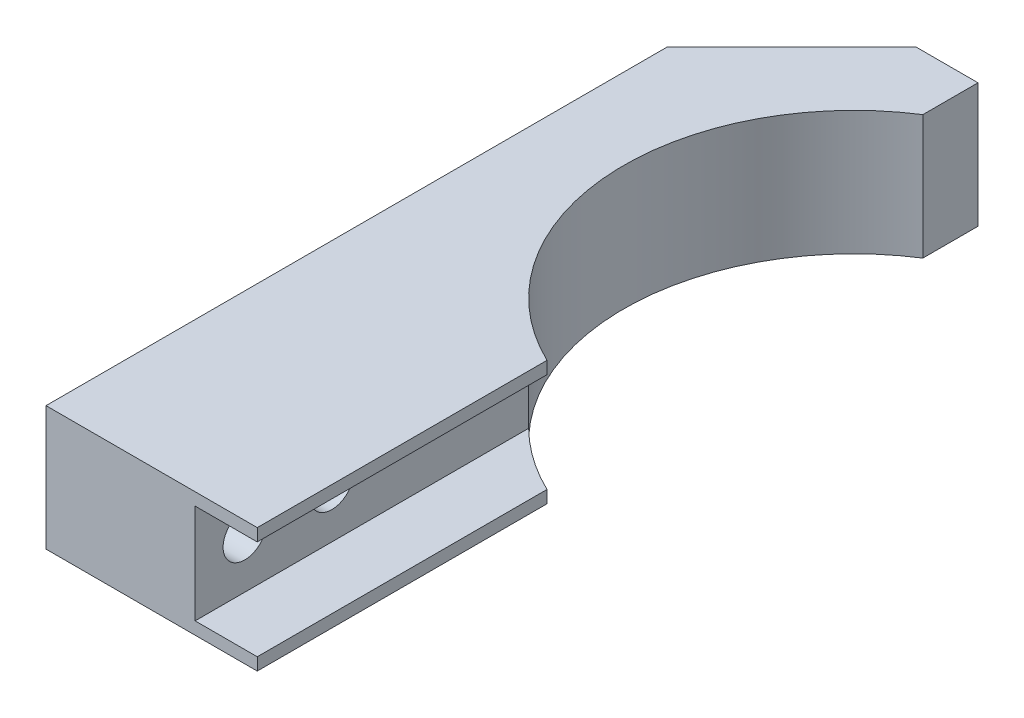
ISO-10303-21;
HEADER;
FILE_DESCRIPTION(('STEP AP214'),'2;1');
FILE_NAME('part.step','',(''),(''),'','','');
FILE_SCHEMA(('AUTOMOTIVE_DESIGN { 1 0 10303 214 1 1 1 1 }'));
ENDSEC;
DATA;
#1=APPLICATION_CONTEXT('core data for automotive mechanical design processes');
#2=APPLICATION_PROTOCOL_DEFINITION('international standard','automotive_design',2000,#1);
#3=PRODUCT_CONTEXT('',#1,'mechanical');
#4=PRODUCT('Part','Part','',(#3));
#5=PRODUCT_RELATED_PRODUCT_CATEGORY('part','',(#4));
#6=PRODUCT_DEFINITION_FORMATION('','',#4);
#7=PRODUCT_DEFINITION_CONTEXT('part definition',#1,'design');
#8=PRODUCT_DEFINITION('design','',#6,#7);
#9=PRODUCT_DEFINITION_SHAPE('','',#8);
#10=(LENGTH_UNIT() NAMED_UNIT(*) SI_UNIT(.MILLI.,.METRE.));
#11=(NAMED_UNIT(*) PLANE_ANGLE_UNIT() SI_UNIT($,.RADIAN.));
#12=(NAMED_UNIT(*) SI_UNIT($,.STERADIAN.) SOLID_ANGLE_UNIT());
#13=UNCERTAINTY_MEASURE_WITH_UNIT(LENGTH_MEASURE(1.E-05),#10,'distance_accuracy_value','');
#14=(GEOMETRIC_REPRESENTATION_CONTEXT(3) GLOBAL_UNCERTAINTY_ASSIGNED_CONTEXT((#13)) GLOBAL_UNIT_ASSIGNED_CONTEXT((#10,
#11,#12)) REPRESENTATION_CONTEXT('',''));
#15=CARTESIAN_POINT('',(0.,0.,0.));
#16=DIRECTION('',(0.,0.,1.));
#17=DIRECTION('',(1.,0.,0.));
#18=AXIS2_PLACEMENT_3D('',#15,#16,#17);
#19=CARTESIAN_POINT('',(-20.,5.,26.));
#20=DIRECTION('',(-1.,0.,0.));
#21=DIRECTION('',(0.,0.,1.));
#22=AXIS2_PLACEMENT_3D('',#19,#20,#21);
#23=PLANE('',#22);
#24=CARTESIAN_POINT('',(-20.,5.,26.));
#25=DIRECTION('',(1.,0.,0.));
#26=DIRECTION('',(0.,0.,-1.));
#27=AXIS2_PLACEMENT_3D('',#24,#25,#26);
#28=CIRCLE('',#27,1.75);
#29=CARTESIAN_POINT('',(-20.,5.,24.25));
#30=VERTEX_POINT('',#29);
#31=EDGE_CURVE('E149',#30,#30,#28,.T.);
#32=ORIENTED_EDGE('',*,*,#31,.T.);
#33=EDGE_LOOP('',(#32));
#34=FACE_BOUND('',#33,.T.);
#35=CARTESIAN_POINT('',(-20.,5.,26.));
#36=DIRECTION('',(-1.,0.,0.));
#37=DIRECTION('',(0.,0.,1.));
#38=AXIS2_PLACEMENT_3D('',#35,#36,#37);
#39=CIRCLE('',#38,3.);
#40=CARTESIAN_POINT('',(-20.,5.,29.));
#41=VERTEX_POINT('',#40);
#42=EDGE_CURVE('E146',#41,#41,#39,.T.);
#43=ORIENTED_EDGE('',*,*,#42,.T.);
#44=EDGE_LOOP('',(#43));
#45=FACE_BOUND('',#44,.T.);
#46=ADVANCED_FACE('F17',(#34,#45),#23,.T.);
#47=CARTESIAN_POINT('',(-20.,5.,19.));
#48=DIRECTION('',(-1.,0.,0.));
#49=DIRECTION('',(0.,0.,1.));
#50=AXIS2_PLACEMENT_3D('',#47,#48,#49);
#51=PLANE('',#50);
#52=CARTESIAN_POINT('',(-20.,5.,19.));
#53=DIRECTION('',(1.,0.,0.));
#54=DIRECTION('',(0.,0.,-1.));
#55=AXIS2_PLACEMENT_3D('',#52,#53,#54);
#56=CIRCLE('',#55,1.75);
#57=CARTESIAN_POINT('',(-20.,5.,17.25));
#58=VERTEX_POINT('',#57);
#59=EDGE_CURVE('E20',#58,#58,#56,.T.);
#60=ORIENTED_EDGE('',*,*,#59,.T.);
#61=EDGE_LOOP('',(#60));
#62=FACE_BOUND('',#61,.T.);
#63=CARTESIAN_POINT('',(-20.,5.,19.));
#64=DIRECTION('',(-1.,0.,0.));
#65=DIRECTION('',(0.,0.,1.));
#66=AXIS2_PLACEMENT_3D('',#63,#64,#65);
#67=CIRCLE('',#66,3.);
#68=CARTESIAN_POINT('',(-20.,5.,22.));
#69=VERTEX_POINT('',#68);
#70=EDGE_CURVE('E143',#69,#69,#67,.T.);
#71=ORIENTED_EDGE('',*,*,#70,.T.);
#72=EDGE_LOOP('',(#71));
#73=FACE_BOUND('',#72,.T.);
#74=ADVANCED_FACE('F158',(#62,#73),#51,.T.);
#75=CARTESIAN_POINT('',(-25.,5.,19.));
#76=DIRECTION('',(1.,0.,0.));
#77=DIRECTION('',(0.,0.,-1.));
#78=AXIS2_PLACEMENT_3D('',#75,#76,#77);
#79=CYLINDRICAL_SURFACE('',#78,1.75);
#80=ORIENTED_EDGE('',*,*,#59,.F.);
#81=EDGE_LOOP('',(#80));
#82=FACE_BOUND('',#81,.T.);
#83=CARTESIAN_POINT('',(-13.,5.,19.));
#84=DIRECTION('',(1.,0.,0.));
#85=DIRECTION('',(0.,0.,-1.));
#86=AXIS2_PLACEMENT_3D('',#83,#84,#85);
#87=CIRCLE('',#86,1.75);
#88=CARTESIAN_POINT('',(-13.,5.,17.25));
#89=VERTEX_POINT('',#88);
#90=EDGE_CURVE('E140',#89,#89,#87,.T.);
#91=ORIENTED_EDGE('',*,*,#90,.T.);
#92=EDGE_LOOP('',(#91));
#93=FACE_BOUND('',#92,.T.);
#94=ADVANCED_FACE('F161',(#82,#93),#79,.F.);
#95=CARTESIAN_POINT('',(-25.,5.,26.));
#96=DIRECTION('',(1.,0.,0.));
#97=DIRECTION('',(0.,0.,-1.));
#98=AXIS2_PLACEMENT_3D('',#95,#96,#97);
#99=CYLINDRICAL_SURFACE('',#98,1.75);
#100=ORIENTED_EDGE('',*,*,#31,.F.);
#101=EDGE_LOOP('',(#100));
#102=FACE_BOUND('',#101,.T.);
#103=CARTESIAN_POINT('',(-13.,5.,26.));
#104=DIRECTION('',(1.,0.,0.));
#105=DIRECTION('',(0.,0.,-1.));
#106=AXIS2_PLACEMENT_3D('',#103,#104,#105);
#107=CIRCLE('',#106,1.75);
#108=CARTESIAN_POINT('',(-13.,5.,24.25));
#109=VERTEX_POINT('',#108);
#110=EDGE_CURVE('E112',#109,#109,#107,.T.);
#111=ORIENTED_EDGE('',*,*,#110,.T.);
#112=EDGE_LOOP('',(#111));
#113=FACE_BOUND('',#112,.T.);
#114=ADVANCED_FACE('F164',(#102,#113),#99,.F.);
#115=CARTESIAN_POINT('',(-8.,0.,1.33753255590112));
#116=DIRECTION('',(-1.,0.,0.));
#117=DIRECTION('',(0.,0.,1.));
#118=AXIS2_PLACEMENT_3D('',#115,#116,#117);
#119=PLANE('',#118);
#120=DIRECTION('',(0.,0.,1.));
#121=VECTOR('',#120,1.);
#122=CARTESIAN_POINT('',(-7.99999999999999,9.,-0.772126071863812));
#123=LINE('',#122,#121);
#124=CARTESIAN_POINT('',(-7.99999999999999,9.,30.));
#125=VERTEX_POINT('',#124);
#126=CARTESIAN_POINT('',(-8.,9.,6.68082731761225));
#127=VERTEX_POINT('',#126);
#128=EDGE_CURVE('E111',#125,#127,#123,.F.);
#129=ORIENTED_EDGE('',*,*,#128,.T.);
#130=DIRECTION('',(0.,1.,0.));
#131=VECTOR('',#130,1.);
#132=CARTESIAN_POINT('',(-8.,0.,6.68082731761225));
#133=LINE('',#132,#131);
#134=CARTESIAN_POINT('',(-8.,10.,6.68082731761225));
#135=VERTEX_POINT('',#134);
#136=EDGE_CURVE('E151',#135,#127,#133,.F.);
#137=ORIENTED_EDGE('',*,*,#136,.F.);
#138=DIRECTION('',(0.,0.,1.));
#139=VECTOR('',#138,1.);
#140=CARTESIAN_POINT('',(-7.99999999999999,10.,0.));
#141=LINE('',#140,#139);
#142=CARTESIAN_POINT('',(-7.99999999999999,10.,30.));
#143=VERTEX_POINT('',#142);
#144=EDGE_CURVE('E221',#143,#135,#141,.F.);
#145=ORIENTED_EDGE('',*,*,#144,.F.);
#146=DIRECTION('',(0.,1.,0.));
#147=VECTOR('',#146,1.);
#148=CARTESIAN_POINT('',(-7.99999999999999,0.,30.));
#149=LINE('',#148,#147);
#150=EDGE_CURVE('E148',#125,#143,#149,.T.);
#151=ORIENTED_EDGE('',*,*,#150,.F.);
#152=EDGE_LOOP('',(#129,#137,#145,#151));
#153=FACE_BOUND('',#152,.T.);
#154=ADVANCED_FACE('F345',(#153),#119,.F.);
#155=CARTESIAN_POINT('',(-20.,5.,26.));
#156=DIRECTION('',(-1.,0.,0.));
#157=DIRECTION('',(0.,0.,1.));
#158=AXIS2_PLACEMENT_3D('',#155,#156,#157);
#159=CYLINDRICAL_SURFACE('',#158,3.);
#160=ORIENTED_EDGE('',*,*,#42,.F.);
#161=EDGE_LOOP('',(#160));
#162=FACE_BOUND('',#161,.T.);
#163=CARTESIAN_POINT('',(-25.,5.,26.));
#164=DIRECTION('',(-1.,0.,0.));
#165=DIRECTION('',(0.,0.,1.));
#166=AXIS2_PLACEMENT_3D('',#163,#164,#165);
#167=CIRCLE('',#166,3.);
#168=CARTESIAN_POINT('',(-25.,5.,29.));
#169=VERTEX_POINT('',#168);
#170=EDGE_CURVE('E134',#169,#169,#167,.T.);
#171=ORIENTED_EDGE('',*,*,#170,.T.);
#172=EDGE_LOOP('',(#171));
#173=FACE_BOUND('',#172,.T.);
#174=ADVANCED_FACE('F343',(#162,#173),#159,.F.);
#175=CARTESIAN_POINT('',(-20.,5.,19.));
#176=DIRECTION('',(-1.,0.,0.));
#177=DIRECTION('',(0.,0.,1.));
#178=AXIS2_PLACEMENT_3D('',#175,#176,#177);
#179=CYLINDRICAL_SURFACE('',#178,3.);
#180=ORIENTED_EDGE('',*,*,#70,.F.);
#181=EDGE_LOOP('',(#180));
#182=FACE_BOUND('',#181,.T.);
#183=CARTESIAN_POINT('',(-25.,5.,19.));
#184=DIRECTION('',(-1.,0.,0.));
#185=DIRECTION('',(0.,0.,1.));
#186=AXIS2_PLACEMENT_3D('',#183,#184,#185);
#187=CIRCLE('',#186,3.);
#188=CARTESIAN_POINT('',(-25.,5.,22.));
#189=VERTEX_POINT('',#188);
#190=EDGE_CURVE('E130',#189,#189,#187,.T.);
#191=ORIENTED_EDGE('',*,*,#190,.T.);
#192=EDGE_LOOP('',(#191));
#193=FACE_BOUND('',#192,.T.);
#194=ADVANCED_FACE('F179',(#182,#193),#179,.F.);
#195=CARTESIAN_POINT('',(-13.,1.,-0.772126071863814));
#196=DIRECTION('',(0.,-1.,0.));
#197=DIRECTION('',(0.,0.,-1.));
#198=AXIS2_PLACEMENT_3D('',#195,#196,#197);
#199=PLANE('',#198);
#200=CARTESIAN_POINT('',(0.,1.,-10.));
#201=DIRECTION('',(0.,1.,0.));
#202=DIRECTION('',(0.,0.,1.));
#203=AXIS2_PLACEMENT_3D('',#200,#201,#202);
#204=CIRCLE('',#203,18.5);
#205=CARTESIAN_POINT('',(-8.,1.,6.68082731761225));
#206=VERTEX_POINT('',#205);
#207=CARTESIAN_POINT('',(-13.,1.,3.16244658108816));
#208=VERTEX_POINT('',#207);
#209=EDGE_CURVE('E118',#206,#208,#204,.F.);
#210=ORIENTED_EDGE('',*,*,#209,.T.);
#211=DIRECTION('',(0.,0.,1.));
#212=VECTOR('',#211,1.);
#213=CARTESIAN_POINT('',(-13.,1.,0.));
#214=LINE('',#213,#212);
#215=CARTESIAN_POINT('',(-13.,1.,30.));
#216=VERTEX_POINT('',#215);
#217=EDGE_CURVE('E104',#208,#216,#214,.T.);
#218=ORIENTED_EDGE('',*,*,#217,.T.);
#219=DIRECTION('',(-1.,0.,0.));
#220=VECTOR('',#219,1.);
#221=CARTESIAN_POINT('',(-25.,0.999999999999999,30.));
#222=LINE('',#221,#220);
#223=CARTESIAN_POINT('',(-7.99999999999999,0.999999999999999,30.));
#224=VERTEX_POINT('',#223);
#225=EDGE_CURVE('E259',#216,#224,#222,.F.);
#226=ORIENTED_EDGE('',*,*,#225,.T.);
#227=DIRECTION('',(0.,0.,1.));
#228=VECTOR('',#227,1.);
#229=CARTESIAN_POINT('',(-8.,0.999999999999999,1.33753255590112));
#230=LINE('',#229,#228);
#231=EDGE_CURVE('E97',#224,#206,#230,.F.);
#232=ORIENTED_EDGE('',*,*,#231,.T.);
#233=EDGE_LOOP('',(#210,#218,#226,#232));
#234=FACE_BOUND('',#233,.T.);
#235=ADVANCED_FACE('F123',(#234),#199,.F.);
#236=CARTESIAN_POINT('',(-13.,0.,0.));
#237=DIRECTION('',(-1.,0.,0.));
#238=DIRECTION('',(0.,0.,1.));
#239=AXIS2_PLACEMENT_3D('',#236,#237,#238);
#240=PLANE('',#239);
#241=DIRECTION('',(0.,1.,0.));
#242=VECTOR('',#241,1.);
#243=CARTESIAN_POINT('',(-13.,0.,3.16244658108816));
#244=LINE('',#243,#242);
#245=CARTESIAN_POINT('',(-13.,9.,3.16244658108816));
#246=VERTEX_POINT('',#245);
#247=EDGE_CURVE('E108',#208,#246,#244,.T.);
#248=ORIENTED_EDGE('',*,*,#247,.T.);
#249=DIRECTION('',(0.,0.,1.));
#250=VECTOR('',#249,1.);
#251=CARTESIAN_POINT('',(-13.,9.,-0.772126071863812));
#252=LINE('',#251,#250);
#253=CARTESIAN_POINT('',(-13.,9.,30.));
#254=VERTEX_POINT('',#253);
#255=EDGE_CURVE('E228',#246,#254,#252,.T.);
#256=ORIENTED_EDGE('',*,*,#255,.T.);
#257=DIRECTION('',(0.,1.,0.));
#258=VECTOR('',#257,1.);
#259=CARTESIAN_POINT('',(-13.,10.,30.));
#260=LINE('',#259,#258);
#261=EDGE_CURVE('E110',#254,#216,#260,.F.);
#262=ORIENTED_EDGE('',*,*,#261,.T.);
#263=ORIENTED_EDGE('',*,*,#217,.F.);
#264=EDGE_LOOP('',(#248,#256,#262,#263));
#265=FACE_BOUND('',#264,.T.);
#266=ORIENTED_EDGE('',*,*,#110,.F.);
#267=EDGE_LOOP('',(#266));
#268=FACE_BOUND('',#267,.T.);
#269=ORIENTED_EDGE('',*,*,#90,.F.);
#270=EDGE_LOOP('',(#269));
#271=FACE_BOUND('',#270,.T.);
#272=ADVANCED_FACE('F106',(#265,#268,#271),#240,.F.);
#273=CARTESIAN_POINT('',(-13.,9.,-0.772126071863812));
#274=DIRECTION('',(0.,1.,0.));
#275=DIRECTION('',(0.,0.,1.));
#276=AXIS2_PLACEMENT_3D('',#273,#274,#275);
#277=PLANE('',#276);
#278=CARTESIAN_POINT('',(0.,9.,-10.));
#279=DIRECTION('',(0.,1.,0.));
#280=DIRECTION('',(0.,0.,1.));
#281=AXIS2_PLACEMENT_3D('',#278,#279,#280);
#282=CIRCLE('',#281,18.5);
#283=EDGE_CURVE('E121',#246,#127,#282,.T.);
#284=ORIENTED_EDGE('',*,*,#283,.T.);
#285=ORIENTED_EDGE('',*,*,#128,.F.);
#286=DIRECTION('',(-1.,0.,0.));
#287=VECTOR('',#286,1.);
#288=CARTESIAN_POINT('',(-25.,9.,30.));
#289=LINE('',#288,#287);
#290=EDGE_CURVE('E241',#125,#254,#289,.T.);
#291=ORIENTED_EDGE('',*,*,#290,.T.);
#292=ORIENTED_EDGE('',*,*,#255,.F.);
#293=EDGE_LOOP('',(#284,#285,#291,#292));
#294=FACE_BOUND('',#293,.T.);
#295=ADVANCED_FACE('F169',(#294),#277,.F.);
#296=CARTESIAN_POINT('',(0.,10.,0.));
#297=DIRECTION('',(0.,1.,0.));
#298=DIRECTION('',(0.,0.,1.));
#299=AXIS2_PLACEMENT_3D('',#296,#297,#298);
#300=PLANE('',#299);
#301=ORIENTED_EDGE('',*,*,#144,.T.);
#302=CARTESIAN_POINT('',(0.,10.,-10.));
#303=DIRECTION('',(0.,1.,0.));
#304=DIRECTION('',(0.,0.,1.));
#305=AXIS2_PLACEMENT_3D('',#302,#303,#304);
#306=CIRCLE('',#305,18.5);
#307=CARTESIAN_POINT('',(-10.,10.,-25.5643824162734));
#308=VERTEX_POINT('',#307);
#309=EDGE_CURVE('E223',#135,#308,#306,.F.);
#310=ORIENTED_EDGE('',*,*,#309,.T.);
#311=DIRECTION('',(0.,0.,1.));
#312=VECTOR('',#311,1.);
#313=CARTESIAN_POINT('',(-10.,10.,-20.3999677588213));
#314=LINE('',#313,#312);
#315=CARTESIAN_POINT('',(-10.,10.,-30.));
#316=VERTEX_POINT('',#315);
#317=EDGE_CURVE('E233',#308,#316,#314,.F.);
#318=ORIENTED_EDGE('',*,*,#317,.T.);
#319=DIRECTION('',(1.,0.,0.));
#320=VECTOR('',#319,1.);
#321=CARTESIAN_POINT('',(-25.,10.,-30.));
#322=LINE('',#321,#320);
#323=CARTESIAN_POINT('',(-15.,10.,-30.));
#324=VERTEX_POINT('',#323);
#325=EDGE_CURVE('E279',#316,#324,#322,.F.);
#326=ORIENTED_EDGE('',*,*,#325,.T.);
#327=DIRECTION('',(0.707106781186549,0.,-0.707106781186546));
#328=VECTOR('',#327,1.);
#329=CARTESIAN_POINT('',(-25.,10.,-20.));
#330=LINE('',#329,#328);
#331=CARTESIAN_POINT('',(-25.,10.,-20.));
#332=VERTEX_POINT('',#331);
#333=EDGE_CURVE('E137',#324,#332,#330,.F.);
#334=ORIENTED_EDGE('',*,*,#333,.T.);
#335=DIRECTION('',(0.,0.,-1.));
#336=VECTOR('',#335,1.);
#337=CARTESIAN_POINT('',(-25.,10.,-30.));
#338=LINE('',#337,#336);
#339=CARTESIAN_POINT('',(-25.,10.,30.));
#340=VERTEX_POINT('',#339);
#341=EDGE_CURVE('E257',#332,#340,#338,.F.);
#342=ORIENTED_EDGE('',*,*,#341,.T.);
#343=DIRECTION('',(-1.,0.,0.));
#344=VECTOR('',#343,1.);
#345=CARTESIAN_POINT('',(-25.,10.,30.));
#346=LINE('',#345,#344);
#347=EDGE_CURVE('E226',#340,#143,#346,.F.);
#348=ORIENTED_EDGE('',*,*,#347,.T.);
#349=EDGE_LOOP('',(#301,#310,#318,#326,#334,#342,#348));
#350=FACE_BOUND('',#349,.T.);
#351=ADVANCED_FACE('F176',(#350),#300,.T.);
#352=CARTESIAN_POINT('',(-25.,10.,-20.));
#353=DIRECTION('',(0.707106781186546,0.,0.707106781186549));
#354=DIRECTION('',(0.707106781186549,0.,-0.707106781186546));
#355=AXIS2_PLACEMENT_3D('',#352,#353,#354);
#356=PLANE('',#355);
#357=DIRECTION('',(0.,1.,0.));
#358=VECTOR('',#357,1.);
#359=CARTESIAN_POINT('',(-15.,10.,-30.));
#360=LINE('',#359,#358);
#361=CARTESIAN_POINT('',(-15.,0.,-30.));
#362=VERTEX_POINT('',#361);
#363=EDGE_CURVE('E286',#324,#362,#360,.F.);
#364=ORIENTED_EDGE('',*,*,#363,.T.);
#365=DIRECTION('',(-0.707106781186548,0.,0.707106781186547));
#366=VECTOR('',#365,1.);
#367=CARTESIAN_POINT('',(-15.,0.,-30.));
#368=LINE('',#367,#366);
#369=CARTESIAN_POINT('',(-25.,0.,-20.));
#370=VERTEX_POINT('',#369);
#371=EDGE_CURVE('E282',#362,#370,#368,.T.);
#372=ORIENTED_EDGE('',*,*,#371,.T.);
#373=DIRECTION('',(0.,1.,0.));
#374=VECTOR('',#373,1.);
#375=CARTESIAN_POINT('',(-25.,10.,-20.));
#376=LINE('',#375,#374);
#377=EDGE_CURVE('E133',#370,#332,#376,.T.);
#378=ORIENTED_EDGE('',*,*,#377,.T.);
#379=ORIENTED_EDGE('',*,*,#333,.F.);
#380=EDGE_LOOP('',(#364,#372,#378,#379));
#381=FACE_BOUND('',#380,.T.);
#382=ADVANCED_FACE('F209',(#381),#356,.F.);
#383=CARTESIAN_POINT('',(-25.,10.,-30.));
#384=DIRECTION('',(1.,0.,0.));
#385=DIRECTION('',(0.,0.,-1.));
#386=AXIS2_PLACEMENT_3D('',#383,#384,#385);
#387=PLANE('',#386);
#388=ORIENTED_EDGE('',*,*,#377,.F.);
#389=DIRECTION('',(0.,0.,1.));
#390=VECTOR('',#389,1.);
#391=CARTESIAN_POINT('',(-25.,0.,0.));
#392=LINE('',#391,#390);
#393=CARTESIAN_POINT('',(-25.,0.,30.));
#394=VERTEX_POINT('',#393);
#395=EDGE_CURVE('E297',#370,#394,#392,.T.);
#396=ORIENTED_EDGE('',*,*,#395,.T.);
#397=DIRECTION('',(0.,1.,0.));
#398=VECTOR('',#397,1.);
#399=CARTESIAN_POINT('',(-25.,10.,30.));
#400=LINE('',#399,#398);
#401=EDGE_CURVE('E254',#394,#340,#400,.T.);
#402=ORIENTED_EDGE('',*,*,#401,.T.);
#403=ORIENTED_EDGE('',*,*,#341,.F.);
#404=EDGE_LOOP('',(#388,#396,#402,#403));
#405=FACE_BOUND('',#404,.T.);
#406=ORIENTED_EDGE('',*,*,#190,.F.);
#407=EDGE_LOOP('',(#406));
#408=FACE_BOUND('',#407,.T.);
#409=ORIENTED_EDGE('',*,*,#170,.F.);
#410=EDGE_LOOP('',(#409));
#411=FACE_BOUND('',#410,.T.);
#412=ADVANCED_FACE('F205',(#405,#408,#411),#387,.F.);
#413=CARTESIAN_POINT('',(-25.,10.,30.));
#414=DIRECTION('',(0.,0.,-1.));
#415=DIRECTION('',(-1.,0.,0.));
#416=AXIS2_PLACEMENT_3D('',#413,#414,#415);
#417=PLANE('',#416);
#418=ORIENTED_EDGE('',*,*,#290,.F.);
#419=ORIENTED_EDGE('',*,*,#150,.T.);
#420=ORIENTED_EDGE('',*,*,#347,.F.);
#421=ORIENTED_EDGE('',*,*,#401,.F.);
#422=DIRECTION('',(1.,0.,0.));
#423=VECTOR('',#422,1.);
#424=CARTESIAN_POINT('',(0.,0.,30.));
#425=LINE('',#424,#423);
#426=CARTESIAN_POINT('',(-7.99999999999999,0.,30.));
#427=VERTEX_POINT('',#426);
#428=EDGE_CURVE('E306',#394,#427,#425,.T.);
#429=ORIENTED_EDGE('',*,*,#428,.T.);
#430=DIRECTION('',(0.,1.,0.));
#431=VECTOR('',#430,1.);
#432=CARTESIAN_POINT('',(-7.99999999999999,0.,30.));
#433=LINE('',#432,#431);
#434=EDGE_CURVE('E250',#427,#224,#433,.T.);
#435=ORIENTED_EDGE('',*,*,#434,.T.);
#436=ORIENTED_EDGE('',*,*,#225,.F.);
#437=ORIENTED_EDGE('',*,*,#261,.F.);
#438=EDGE_LOOP('',(#418,#419,#420,#421,#429,#435,#436,#437));
#439=FACE_BOUND('',#438,.T.);
#440=ADVANCED_FACE('F201',(#439),#417,.F.);
#441=CARTESIAN_POINT('',(-8.,0.,1.33753255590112));
#442=DIRECTION('',(-1.,0.,0.));
#443=DIRECTION('',(0.,0.,1.));
#444=AXIS2_PLACEMENT_3D('',#441,#442,#443);
#445=PLANE('',#444);
#446=ORIENTED_EDGE('',*,*,#231,.F.);
#447=ORIENTED_EDGE('',*,*,#434,.F.);
#448=DIRECTION('',(0.,0.,1.));
#449=VECTOR('',#448,1.);
#450=CARTESIAN_POINT('',(-7.99999999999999,0.,0.));
#451=LINE('',#450,#449);
#452=CARTESIAN_POINT('',(-8.,0.,6.68082731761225));
#453=VERTEX_POINT('',#452);
#454=EDGE_CURVE('E238',#427,#453,#451,.F.);
#455=ORIENTED_EDGE('',*,*,#454,.T.);
#456=DIRECTION('',(0.,1.,0.));
#457=VECTOR('',#456,1.);
#458=CARTESIAN_POINT('',(-8.,0.,6.68082731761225));
#459=LINE('',#458,#457);
#460=EDGE_CURVE('E124',#453,#206,#459,.T.);
#461=ORIENTED_EDGE('',*,*,#460,.T.);
#462=EDGE_LOOP('',(#446,#447,#455,#461));
#463=FACE_BOUND('',#462,.T.);
#464=ADVANCED_FACE('F198',(#463),#445,.F.);
#465=CARTESIAN_POINT('',(0.,0.,-10.));
#466=DIRECTION('',(0.,1.,0.));
#467=DIRECTION('',(0.,0.,1.));
#468=AXIS2_PLACEMENT_3D('',#465,#466,#467);
#469=CYLINDRICAL_SURFACE('',#468,18.5);
#470=DIRECTION('',(0.,1.,0.));
#471=VECTOR('',#470,1.);
#472=CARTESIAN_POINT('',(-10.,0.,-25.5643824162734));
#473=LINE('',#472,#471);
#474=CARTESIAN_POINT('',(-10.,0.,-25.5643824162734));
#475=VERTEX_POINT('',#474);
#476=EDGE_CURVE('E232',#475,#308,#473,.T.);
#477=ORIENTED_EDGE('',*,*,#476,.T.);
#478=ORIENTED_EDGE('',*,*,#309,.F.);
#479=ORIENTED_EDGE('',*,*,#136,.T.);
#480=ORIENTED_EDGE('',*,*,#283,.F.);
#481=ORIENTED_EDGE('',*,*,#247,.F.);
#482=ORIENTED_EDGE('',*,*,#209,.F.);
#483=ORIENTED_EDGE('',*,*,#460,.F.);
#484=CARTESIAN_POINT('',(0.,0.,-10.));
#485=DIRECTION('',(0.,1.,0.));
#486=DIRECTION('',(0.,0.,1.));
#487=AXIS2_PLACEMENT_3D('',#484,#485,#486);
#488=CIRCLE('',#487,18.5);
#489=EDGE_CURVE('E236',#453,#475,#488,.F.);
#490=ORIENTED_EDGE('',*,*,#489,.T.);
#491=EDGE_LOOP('',(#477,#478,#479,#480,#481,#482,#483,#490));
#492=FACE_BOUND('',#491,.T.);
#493=ADVANCED_FACE('F117',(#492),#469,.F.);
#494=CARTESIAN_POINT('',(-10.,0.,-20.3999677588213));
#495=DIRECTION('',(-1.,0.,0.));
#496=DIRECTION('',(0.,0.,1.));
#497=AXIS2_PLACEMENT_3D('',#494,#495,#496);
#498=PLANE('',#497);
#499=ORIENTED_EDGE('',*,*,#476,.F.);
#500=DIRECTION('',(0.,0.,1.));
#501=VECTOR('',#500,1.);
#502=CARTESIAN_POINT('',(-10.,0.,0.));
#503=LINE('',#502,#501);
#504=CARTESIAN_POINT('',(-10.,0.,-30.));
#505=VERTEX_POINT('',#504);
#506=EDGE_CURVE('E26',#475,#505,#503,.F.);
#507=ORIENTED_EDGE('',*,*,#506,.T.);
#508=DIRECTION('',(0.,1.,0.));
#509=VECTOR('',#508,1.);
#510=CARTESIAN_POINT('',(-10.,10.,-30.));
#511=LINE('',#510,#509);
#512=EDGE_CURVE('E34',#505,#316,#511,.T.);
#513=ORIENTED_EDGE('',*,*,#512,.T.);
#514=ORIENTED_EDGE('',*,*,#317,.F.);
#515=EDGE_LOOP('',(#499,#507,#513,#514));
#516=FACE_BOUND('',#515,.T.);
#517=ADVANCED_FACE('F189',(#516),#498,.F.);
#518=CARTESIAN_POINT('',(-25.,10.,-30.));
#519=DIRECTION('',(0.,0.,1.));
#520=DIRECTION('',(1.,0.,0.));
#521=AXIS2_PLACEMENT_3D('',#518,#519,#520);
#522=PLANE('',#521);
#523=ORIENTED_EDGE('',*,*,#512,.F.);
#524=DIRECTION('',(1.,0.,0.));
#525=VECTOR('',#524,1.);
#526=CARTESIAN_POINT('',(0.,0.,-30.));
#527=LINE('',#526,#525);
#528=EDGE_CURVE('E11',#505,#362,#527,.F.);
#529=ORIENTED_EDGE('',*,*,#528,.T.);
#530=ORIENTED_EDGE('',*,*,#363,.F.);
#531=ORIENTED_EDGE('',*,*,#325,.F.);
#532=EDGE_LOOP('',(#523,#529,#530,#531));
#533=FACE_BOUND('',#532,.T.);
#534=ADVANCED_FACE('F183',(#533),#522,.F.);
#535=CARTESIAN_POINT('',(0.,0.,0.));
#536=DIRECTION('',(0.,1.,0.));
#537=DIRECTION('',(0.,0.,1.));
#538=AXIS2_PLACEMENT_3D('',#535,#536,#537);
#539=PLANE('',#538);
#540=ORIENTED_EDGE('',*,*,#506,.F.);
#541=ORIENTED_EDGE('',*,*,#489,.F.);
#542=ORIENTED_EDGE('',*,*,#454,.F.);
#543=ORIENTED_EDGE('',*,*,#428,.F.);
#544=ORIENTED_EDGE('',*,*,#395,.F.);
#545=ORIENTED_EDGE('',*,*,#371,.F.);
#546=ORIENTED_EDGE('',*,*,#528,.F.);
#547=EDGE_LOOP('',(#540,#541,#542,#543,#544,#545,#546));
#548=FACE_BOUND('',#547,.T.);
#549=ADVANCED_FACE('F181',(#548),#539,.F.);
#550=CLOSED_SHELL('',(#46,#74,#94,#114,#154,#174,#194,#235,#272,#295,#351,#382,#412,#440,#464,
#493,#517,#534,#549));
#551=MANIFOLD_SOLID_BREP('B1',#550);
#552=ADVANCED_BREP_SHAPE_REPRESENTATION('',(#18,#551),#14);
#553=SHAPE_DEFINITION_REPRESENTATION(#9,#552);
ENDSEC;
END-ISO-10303-21;
